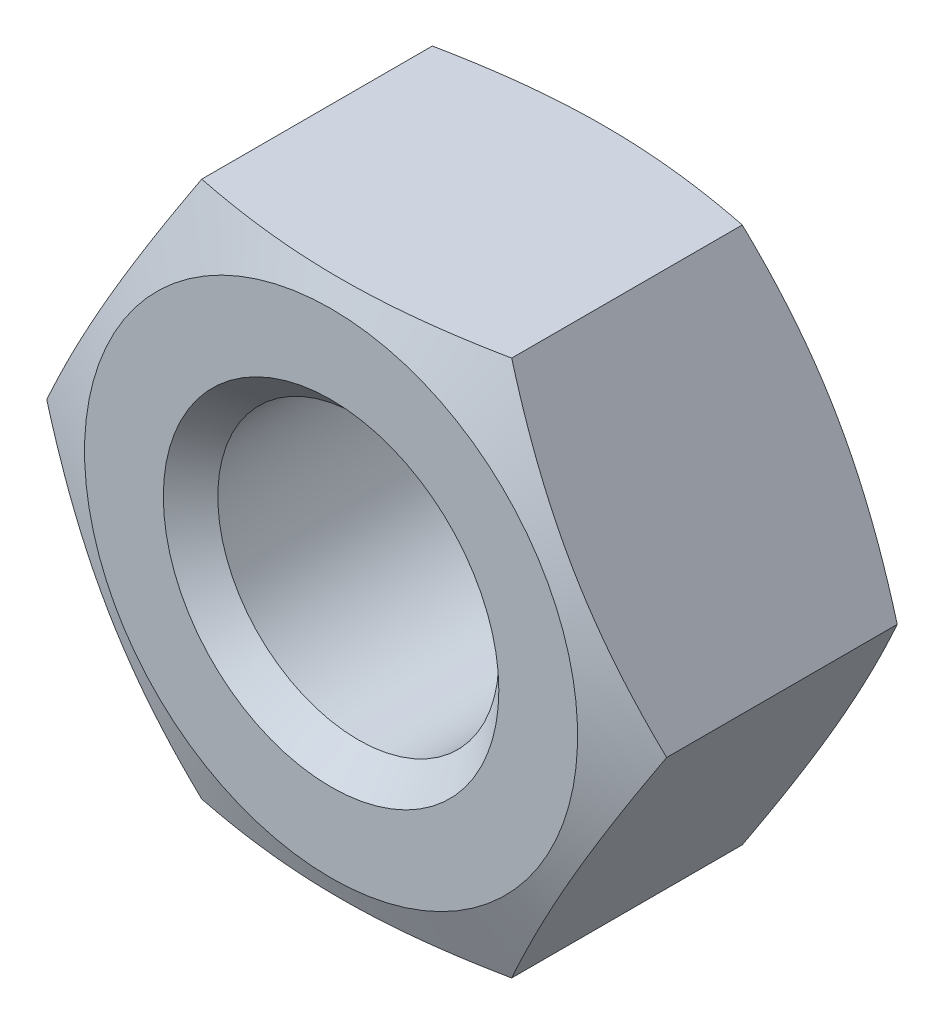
ISO-10303-21;
HEADER;
FILE_DESCRIPTION(('STEP AP214'),'2;1');
FILE_NAME('part.step','',(''),(''),'','','');
FILE_SCHEMA(('AUTOMOTIVE_DESIGN { 1 0 10303 214 1 1 1 1 }'));
ENDSEC;
DATA;
#1=APPLICATION_CONTEXT('core data for automotive mechanical design processes');
#2=APPLICATION_PROTOCOL_DEFINITION('international standard','automotive_design',2000,#1);
#3=PRODUCT_CONTEXT('',#1,'mechanical');
#4=PRODUCT('Part','Part','',(#3));
#5=PRODUCT_RELATED_PRODUCT_CATEGORY('part','',(#4));
#6=PRODUCT_DEFINITION_FORMATION('','',#4);
#7=PRODUCT_DEFINITION_CONTEXT('part definition',#1,'design');
#8=PRODUCT_DEFINITION('design','',#6,#7);
#9=PRODUCT_DEFINITION_SHAPE('','',#8);
#10=(LENGTH_UNIT() NAMED_UNIT(*) SI_UNIT(.MILLI.,.METRE.));
#11=(NAMED_UNIT(*) PLANE_ANGLE_UNIT() SI_UNIT($,.RADIAN.));
#12=(NAMED_UNIT(*) SI_UNIT($,.STERADIAN.) SOLID_ANGLE_UNIT());
#13=UNCERTAINTY_MEASURE_WITH_UNIT(LENGTH_MEASURE(1.E-05),#10,'distance_accuracy_value','');
#14=(GEOMETRIC_REPRESENTATION_CONTEXT(3) GLOBAL_UNCERTAINTY_ASSIGNED_CONTEXT((#13)) GLOBAL_UNIT_ASSIGNED_CONTEXT((#10,
#11,#12)) REPRESENTATION_CONTEXT('',''));
#15=CARTESIAN_POINT('',(0.,0.,0.));
#16=DIRECTION('',(0.,0.,1.));
#17=DIRECTION('',(1.,0.,0.));
#18=AXIS2_PLACEMENT_3D('',#15,#16,#17);
#19=CARTESIAN_POINT('',(9.2376,0.,8.4));
#20=DIRECTION('',(0.,0.,1.));
#21=DIRECTION('',(1.,0.,0.));
#22=AXIS2_PLACEMENT_3D('',#19,#20,#21);
#23=PLANE('',#22);
#24=CARTESIAN_POINT('',(0.,0.,8.4));
#25=DIRECTION('',(0.,0.,-1.));
#26=DIRECTION('',(0.,1.,0.));
#27=AXIS2_PLACEMENT_3D('',#24,#25,#26);
#28=CIRCLE('',#27,5.);
#29=CARTESIAN_POINT('',(0.,5.,8.4));
#30=VERTEX_POINT('',#29);
#31=EDGE_CURVE('E201',#30,#30,#28,.T.);
#32=ORIENTED_EDGE('',*,*,#31,.T.);
#33=EDGE_LOOP('',(#32));
#34=FACE_BOUND('',#33,.T.);
#35=CARTESIAN_POINT('',(0.,0.,8.4));
#36=DIRECTION('',(0.,0.,-1.));
#37=DIRECTION('',(0.,1.,0.));
#38=AXIS2_PLACEMENT_3D('',#35,#36,#37);
#39=CIRCLE('',#38,7.34753367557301);
#40=CARTESIAN_POINT('',(0.,7.34753367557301,8.4));
#41=VERTEX_POINT('',#40);
#42=EDGE_CURVE('E204',#41,#41,#39,.T.);
#43=ORIENTED_EDGE('',*,*,#42,.F.);
#44=EDGE_LOOP('',(#43));
#45=FACE_BOUND('',#44,.T.);
#46=ADVANCED_FACE('F12',(#34,#45),#23,.T.);
#47=CARTESIAN_POINT('',(0.,0.,8.4));
#48=DIRECTION('',(0.,0.,1.));
#49=DIRECTION('',(0.,-1.,0.));
#50=AXIS2_PLACEMENT_3D('',#47,#48,#49);
#51=CONICAL_SURFACE('',#50,5.,0.785398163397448);
#52=CARTESIAN_POINT('',(0.,0.,7.588125));
#53=DIRECTION('',(0.,0.,-1.));
#54=DIRECTION('',(0.,1.,0.));
#55=AXIS2_PLACEMENT_3D('',#52,#53,#54);
#56=CIRCLE('',#55,4.188125);
#57=CARTESIAN_POINT('',(0.,4.188125,7.588125));
#58=VERTEX_POINT('',#57);
#59=EDGE_CURVE('E93',#58,#58,#56,.T.);
#60=ORIENTED_EDGE('',*,*,#59,.T.);
#61=EDGE_LOOP('',(#60));
#62=FACE_BOUND('',#61,.T.);
#63=ORIENTED_EDGE('',*,*,#31,.F.);
#64=EDGE_LOOP('',(#63));
#65=FACE_BOUND('',#64,.T.);
#66=ADVANCED_FACE('F136',(#62,#65),#51,.F.);
#67=CARTESIAN_POINT('',(0.,0.,0.));
#68=DIRECTION('',(0.,0.,-1.));
#69=DIRECTION('',(0.,1.,0.));
#70=AXIS2_PLACEMENT_3D('',#67,#68,#69);
#71=CYLINDRICAL_SURFACE('',#70,4.188125);
#72=CARTESIAN_POINT('',(0.,0.,0.811875));
#73=DIRECTION('',(0.,0.,-1.));
#74=DIRECTION('',(0.,1.,0.));
#75=AXIS2_PLACEMENT_3D('',#72,#73,#74);
#76=CIRCLE('',#75,4.188125);
#77=CARTESIAN_POINT('',(0.,4.188125,0.811875));
#78=VERTEX_POINT('',#77);
#79=EDGE_CURVE('E90',#78,#78,#76,.T.);
#80=ORIENTED_EDGE('',*,*,#79,.T.);
#81=EDGE_LOOP('',(#80));
#82=FACE_BOUND('',#81,.T.);
#83=ORIENTED_EDGE('',*,*,#59,.F.);
#84=EDGE_LOOP('',(#83));
#85=FACE_BOUND('',#84,.T.);
#86=ADVANCED_FACE('F196',(#82,#85),#71,.F.);
#87=CARTESIAN_POINT('',(0.,0.,0.));
#88=DIRECTION('',(0.,0.,-1.));
#89=DIRECTION('',(0.,1.,0.));
#90=AXIS2_PLACEMENT_3D('',#87,#88,#89);
#91=CONICAL_SURFACE('',#90,5.,0.785398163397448);
#92=ORIENTED_EDGE('',*,*,#79,.F.);
#93=EDGE_LOOP('',(#92));
#94=FACE_BOUND('',#93,.T.);
#95=CARTESIAN_POINT('',(0.,0.,0.));
#96=DIRECTION('',(0.,0.,-1.));
#97=DIRECTION('',(0.,1.,0.));
#98=AXIS2_PLACEMENT_3D('',#95,#96,#97);
#99=CIRCLE('',#98,5.);
#100=CARTESIAN_POINT('',(0.,5.,0.));
#101=VERTEX_POINT('',#100);
#102=EDGE_CURVE('E205',#101,#101,#99,.T.);
#103=ORIENTED_EDGE('',*,*,#102,.T.);
#104=EDGE_LOOP('',(#103));
#105=FACE_BOUND('',#104,.T.);
#106=ADVANCED_FACE('F134',(#94,#105),#91,.F.);
#107=CARTESIAN_POINT('',(0.,0.,7.63636363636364));
#108=DIRECTION('',(0.,0.,-1.));
#109=DIRECTION('',(0.,1.,0.));
#110=AXIS2_PLACEMENT_3D('',#107,#108,#109);
#111=CONICAL_SURFACE('',#110,9.2376,1.18682389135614);
#112=ORIENTED_EDGE('',*,*,#42,.T.);
#113=EDGE_LOOP('',(#112));
#114=FACE_BOUND('',#113,.T.);
#115=CARTESIAN_POINT('',(-12.208088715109,-7.99999626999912,5.47151041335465));
#116=CARTESIAN_POINT('',(-11.8472558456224,-7.99999626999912,5.59341262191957));
#117=CARTESIAN_POINT('',(-11.4859428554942,-7.99999626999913,5.71391988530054));
#118=CARTESIAN_POINT('',(-10.7621082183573,-7.99999626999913,5.95136513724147));
#119=CARTESIAN_POINT('',(-10.3995864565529,-7.99999626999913,6.06830277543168));
#120=CARTESIAN_POINT('',(-9.67227861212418,-7.99999626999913,6.29808254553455));
#121=CARTESIAN_POINT('',(-9.30748917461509,-7.99999626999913,6.41091409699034));
#122=CARTESIAN_POINT('',(-8.57626257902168,-7.99999626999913,6.63109410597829));
#123=CARTESIAN_POINT('',(-8.20982546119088,-7.99999626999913,6.73844269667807));
#124=CARTESIAN_POINT('',(-7.47973450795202,-7.99999626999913,6.94493737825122));
#125=CARTESIAN_POINT('',(-7.11610564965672,-7.99999626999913,7.04417133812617));
#126=CARTESIAN_POINT('',(-6.38663585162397,-7.99999626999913,7.23425396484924));
#127=CARTESIAN_POINT('',(-6.02079484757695,-7.99999626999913,7.32510238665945));
#128=CARTESIAN_POINT('',(-5.28684843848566,-7.99999626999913,7.49624245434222));
#129=CARTESIAN_POINT('',(-4.91874442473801,-7.99999626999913,7.57654001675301));
#130=CARTESIAN_POINT('',(-4.17992018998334,-7.99999626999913,7.72409513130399));
#131=CARTESIAN_POINT('',(-3.809200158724,-7.99999626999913,7.79135361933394));
#132=CARTESIAN_POINT('',(-3.1412950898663,-7.99999626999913,7.89787695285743));
#133=CARTESIAN_POINT('',(-2.8445768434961,-7.99999626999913,7.9400537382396));
#134=CARTESIAN_POINT('',(-2.24972708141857,-7.99999626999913,8.0129659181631));
#135=CARTESIAN_POINT('',(-1.95159560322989,-7.99999626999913,8.04370161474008));
#136=CARTESIAN_POINT('',(-1.35447911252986,-7.99999626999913,8.09251487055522));
#137=CARTESIAN_POINT('',(-1.05549477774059,-7.99999626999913,8.11060061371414));
#138=CARTESIAN_POINT('',(-0.457010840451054,-7.99999626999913,8.13335586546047));
#139=CARTESIAN_POINT('',(-0.157511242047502,-7.99999626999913,8.13802548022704));
#140=CARTESIAN_POINT('',(0.44283770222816,-7.99999626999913,8.13372274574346));
#141=CARTESIAN_POINT('',(0.743686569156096,-7.99999626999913,8.12468429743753));
#142=CARTESIAN_POINT('',(1.34468098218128,-7.99999626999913,8.09325950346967));
#143=CARTESIAN_POINT('',(1.6448265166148,-7.99999626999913,8.07087293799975));
#144=CARTESIAN_POINT('',(2.2441114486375,-7.99999626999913,8.01369199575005));
#145=CARTESIAN_POINT('',(2.54325008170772,-7.99999626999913,7.9788897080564));
#146=CARTESIAN_POINT('',(3.14000765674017,-7.99999626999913,7.89819004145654));
#147=CARTESIAN_POINT('',(3.43762660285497,-7.99999626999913,7.8522926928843));
#148=CARTESIAN_POINT('',(4.08078984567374,-7.99999626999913,7.74237997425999));
#149=CARTESIAN_POINT('',(4.42603382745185,-7.99999626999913,7.67661873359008));
#150=CARTESIAN_POINT('',(5.11428681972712,-7.99999626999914,7.53420963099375));
#151=CARTESIAN_POINT('',(5.45729554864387,-7.99999626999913,7.45756042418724));
#152=CARTESIAN_POINT('',(6.14136263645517,-7.99999626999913,7.29534779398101));
#153=CARTESIAN_POINT('',(6.48241994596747,-7.99999626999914,7.20977997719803));
#154=CARTESIAN_POINT('',(7.16262373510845,-7.99999626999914,7.03145121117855));
#155=CARTESIAN_POINT('',(7.50177028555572,-7.99999626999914,6.93869053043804));
#156=CARTESIAN_POINT('',(8.17929752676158,-7.99999626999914,6.74709135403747));
#157=CARTESIAN_POINT('',(8.51767386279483,-7.99999626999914,6.64823752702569));
#158=CARTESIAN_POINT('',(9.19299804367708,-7.99999626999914,6.44577360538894));
#159=CARTESIAN_POINT('',(9.52994587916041,-7.99999626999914,6.34216347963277));
#160=CARTESIAN_POINT('',(10.2025268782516,-7.99999626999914,6.13109100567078));
#161=CARTESIAN_POINT('',(10.5381603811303,-7.99999626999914,6.02362973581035));
#162=CARTESIAN_POINT('',(11.2083889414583,-7.99999626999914,5.80551193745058));
#163=CARTESIAN_POINT('',(11.5429839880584,-7.99999626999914,5.69485537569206));
#164=CARTESIAN_POINT('',(12.5409587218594,-7.99999626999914,5.36044806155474));
#165=CARTESIAN_POINT('',(13.2030406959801,-7.99999626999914,5.13282581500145));
#166=CARTESIAN_POINT('',(14.5246994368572,-7.99999626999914,4.6703057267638));
#167=CARTESIAN_POINT('',(15.1842760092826,-7.99999626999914,4.43540733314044));
#168=CARTESIAN_POINT('',(16.4971634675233,-7.99999626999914,3.96190830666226));
#169=CARTESIAN_POINT('',(17.1504869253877,-7.99999626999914,3.72334248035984));
#170=CARTESIAN_POINT('',(18.1293548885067,-7.99999626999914,3.3625976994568));
#171=CARTESIAN_POINT('',(18.4554375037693,-7.99999626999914,3.24187446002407));
#172=CARTESIAN_POINT('',(19.1072846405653,-7.99999626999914,2.9995757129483));
#173=CARTESIAN_POINT('',(19.4330491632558,-7.99999626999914,2.87800020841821));
#174=CARTESIAN_POINT('',(19.7586760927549,-7.99999626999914,2.75605707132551));
#175=B_SPLINE_CURVE_WITH_KNOTS('',3,(#115,#116,#117,#118,#119,#120,#121,#122,#123,#124,#125,
#126,#127,#128,#129,#130,#131,#132,#133,#134,#135,#136,#137,#138,#139,#140,#141,#142,#143,#144,
#145,#146,#147,#148,#149,#150,#151,#152,#153,#154,#155,#156,#157,#158,#159,#160,#161,#162,#163,
#164,#165,#166,#167,#168,#169,#170,#171,#172,#173,#174),.UNSPECIFIED.,.F.,.F.,(4,2,2,2,2,2,2,2,
2,2,2,2,2,2,2,2,2,2,2,2,2,2,2,2,2,2,2,2,2,4),(0.,1.14261401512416,2.28533982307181,
3.43082722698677,4.57628679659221,5.70698666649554,6.83771956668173,7.9678156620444,
9.0978306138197,9.99674169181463,10.8956290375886,11.7939343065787,12.6922324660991,
13.5948759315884,14.4975342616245,15.4007687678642,16.3040008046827,17.3581349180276,
18.41239935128,19.4671856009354,20.5219324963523,21.5794511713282,22.636976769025,
23.6942085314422,24.7514513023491,26.8517336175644,28.952175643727,31.0387116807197,
32.0818483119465,33.1249811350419),.UNSPECIFIED.);
#176=CARTESIAN_POINT('',(-4.6188,-7.99999626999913,7.63636363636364));
#177=VERTEX_POINT('',#176);
#178=CARTESIAN_POINT('',(4.6188,-7.99999626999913,7.63636363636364));
#179=VERTEX_POINT('',#178);
#180=EDGE_CURVE('E73',#177,#179,#175,.T.);
#181=ORIENTED_EDGE('',*,*,#180,.T.);
#182=CARTESIAN_POINT('',(4.61879988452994,-7.99999646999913,7.63636358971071));
#183=CARTESIAN_POINT('',(4.78016828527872,-7.72049820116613,7.70156440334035));
#184=CARTESIAN_POINT('',(4.94206929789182,-7.44007742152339,7.76185304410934));
#185=CARTESIAN_POINT('',(5.26694187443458,-6.87738161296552,7.87075300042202));
#186=CARTESIAN_POINT('',(5.42991400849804,-6.59510559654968,7.91935747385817));
#187=CARTESIAN_POINT('',(5.75669685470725,-6.02910110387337,8.00294310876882));
#188=CARTESIAN_POINT('',(5.92050730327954,-5.7453730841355,8.03792831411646));
#189=CARTESIAN_POINT('',(6.24873668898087,-5.17686311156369,8.09265414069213));
#190=CARTESIAN_POINT('',(6.41315548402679,-4.89208140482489,8.11239812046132));
#191=CARTESIAN_POINT('',(6.739490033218,-4.32685338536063,8.13541369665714));
#192=CARTESIAN_POINT('',(6.90140088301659,-4.04641556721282,8.13895930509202));
#193=CARTESIAN_POINT('',(7.22512690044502,-3.48570565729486,8.13013256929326));
#194=CARTESIAN_POINT('',(7.38694205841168,-3.20543358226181,8.11775882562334));
#195=CARTESIAN_POINT('',(7.7099879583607,-2.6459016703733,8.07775857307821));
#196=CARTESIAN_POINT('',(7.87121900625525,-2.36664130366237,8.0501417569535));
#197=CARTESIAN_POINT('',(8.19291130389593,-1.80945389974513,7.9809937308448));
#198=CARTESIAN_POINT('',(8.35337262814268,-1.53152673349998,7.93946389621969));
#199=CARTESIAN_POINT('',(8.57389118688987,-1.14957738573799,7.87381724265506));
#200=CARTESIAN_POINT('',(8.63435021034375,-1.04485928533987,7.85492627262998));
#201=CARTESIAN_POINT('',(8.75512556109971,-0.835670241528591,7.81549930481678));
#202=CARTESIAN_POINT('',(8.81544190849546,-0.731199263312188,7.79496355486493));
#203=CARTESIAN_POINT('',(8.93614338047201,-0.522138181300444,7.75226892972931));
#204=CARTESIAN_POINT('',(8.99652803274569,-0.417548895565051,7.73010473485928));
#205=CARTESIAN_POINT('',(9.11716503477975,-0.208599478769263,7.68430965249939));
#206=CARTESIAN_POINT('',(9.17741736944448,-0.104239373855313,7.66067860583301));
#207=CARTESIAN_POINT('',(9.23760011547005,1.99999999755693E-07,7.63636358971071));
#208=B_SPLINE_CURVE_WITH_KNOTS('',3,(#182,#183,#184,#185,#186,#187,#188,#189,#190,#191,#192,
#193,#194,#195,#196,#197,#198,#199,#200,#201,#202,#203,#204,#205,#206,#207),.UNSPECIFIED.,.F.,
.F.,(4,2,2,2,2,2,2,2,2,2,2,2,4),(0.,0.987840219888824,1.97625750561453,2.96438108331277,
3.95228685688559,4.92341776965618,5.89463405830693,6.86523348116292,7.83573698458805,
8.20288448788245,8.56997677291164,8.93832669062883,9.3067166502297),.UNSPECIFIED.);
#209=CARTESIAN_POINT('',(9.2376,0.,7.63636363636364));
#210=VERTEX_POINT('',#209);
#211=EDGE_CURVE('E158',#179,#210,#208,.T.);
#212=ORIENTED_EDGE('',*,*,#211,.T.);
#213=CARTESIAN_POINT('',(9.23760011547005,-2.E-07,7.63636358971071));
#214=CARTESIAN_POINT('',(9.07623171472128,0.279498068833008,7.70156440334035));
#215=CARTESIAN_POINT('',(8.91433070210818,0.559918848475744,7.76185304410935));
#216=CARTESIAN_POINT('',(8.58945812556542,1.12261465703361,7.87075300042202));
#217=CARTESIAN_POINT('',(8.42648599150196,1.40489067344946,7.91935747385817));
#218=CARTESIAN_POINT('',(8.09970314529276,1.97089516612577,8.00294310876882));
#219=CARTESIAN_POINT('',(7.93589269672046,2.25462318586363,8.03792831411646));
#220=CARTESIAN_POINT('',(7.60766331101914,2.82313315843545,8.09265414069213));
#221=CARTESIAN_POINT('',(7.44324451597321,3.10791486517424,8.11239812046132));
#222=CARTESIAN_POINT('',(7.116909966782,3.6731428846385,8.13541369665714));
#223=CARTESIAN_POINT('',(6.95499911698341,3.95358070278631,8.13895930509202));
#224=CARTESIAN_POINT('',(6.63127309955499,4.51429061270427,8.13013256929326));
#225=CARTESIAN_POINT('',(6.46945794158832,4.79456268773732,8.11775882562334));
#226=CARTESIAN_POINT('',(6.1464120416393,5.35409459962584,8.07775857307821));
#227=CARTESIAN_POINT('',(5.98518099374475,5.63335496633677,8.0501417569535));
#228=CARTESIAN_POINT('',(5.66348869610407,6.190542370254,7.9809937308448));
#229=CARTESIAN_POINT('',(5.50302737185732,6.46846953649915,7.93946389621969));
#230=CARTESIAN_POINT('',(5.28250881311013,6.85041888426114,7.87381724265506));
#231=CARTESIAN_POINT('',(5.22204978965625,6.95513698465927,7.85492627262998));
#232=CARTESIAN_POINT('',(5.10127443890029,7.16432602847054,7.81549930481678));
#233=CARTESIAN_POINT('',(5.04095809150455,7.26879700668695,7.79496355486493));
#234=CARTESIAN_POINT('',(4.92025661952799,7.47785808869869,7.75226892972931));
#235=CARTESIAN_POINT('',(4.85987196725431,7.58244737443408,7.73010473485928));
#236=CARTESIAN_POINT('',(4.73923496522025,7.79139679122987,7.68430965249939));
#237=CARTESIAN_POINT('',(4.67898263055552,7.89575689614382,7.66067860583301));
#238=CARTESIAN_POINT('',(4.61879988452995,7.99999646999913,7.63636358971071));
#239=B_SPLINE_CURVE_WITH_KNOTS('',3,(#213,#214,#215,#216,#217,#218,#219,#220,#221,#222,#223,
#224,#225,#226,#227,#228,#229,#230,#231,#232,#233,#234,#235,#236,#237,#238),.UNSPECIFIED.,.F.,
.F.,(4,2,2,2,2,2,2,2,2,2,2,2,4),(0.,0.987840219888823,1.97625750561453,2.96438108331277,
3.95228685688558,4.92341776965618,5.89463405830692,6.86523348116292,7.83573698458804,
8.20288448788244,8.56997677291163,8.93832669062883,9.3067166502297),.UNSPECIFIED.);
#240=CARTESIAN_POINT('',(4.6188,7.99999626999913,7.63636363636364));
#241=VERTEX_POINT('',#240);
#242=EDGE_CURVE('E35',#210,#241,#239,.T.);
#243=ORIENTED_EDGE('',*,*,#242,.T.);
#244=CARTESIAN_POINT('',(-12.208088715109,7.99999626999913,5.47151041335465));
#245=CARTESIAN_POINT('',(-11.8472558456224,7.99999626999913,5.59341262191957));
#246=CARTESIAN_POINT('',(-11.4859428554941,7.99999626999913,5.71391988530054));
#247=CARTESIAN_POINT('',(-10.7621082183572,7.99999626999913,5.95136513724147));
#248=CARTESIAN_POINT('',(-10.3995864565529,7.99999626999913,6.06830277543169));
#249=CARTESIAN_POINT('',(-9.67227861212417,7.99999626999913,6.29808254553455));
#250=CARTESIAN_POINT('',(-9.30748917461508,7.99999626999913,6.41091409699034));
#251=CARTESIAN_POINT('',(-8.57626257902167,7.99999626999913,6.6310941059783));
#252=CARTESIAN_POINT('',(-8.20982546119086,7.99999626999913,6.73844269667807));
#253=CARTESIAN_POINT('',(-7.47973450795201,7.99999626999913,6.94493737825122));
#254=CARTESIAN_POINT('',(-7.11610564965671,7.99999626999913,7.04417133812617));
#255=CARTESIAN_POINT('',(-6.38663585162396,7.99999626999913,7.23425396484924));
#256=CARTESIAN_POINT('',(-6.02079484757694,7.99999626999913,7.32510238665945));
#257=CARTESIAN_POINT('',(-5.28684843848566,7.99999626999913,7.49624245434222));
#258=CARTESIAN_POINT('',(-4.91874442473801,7.99999626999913,7.57654001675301));
#259=CARTESIAN_POINT('',(-4.17992018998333,7.99999626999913,7.72409513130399));
#260=CARTESIAN_POINT('',(-3.809200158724,7.99999626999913,7.79135361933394));
#261=CARTESIAN_POINT('',(-3.14129508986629,7.99999626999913,7.89787695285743));
#262=CARTESIAN_POINT('',(-2.84457684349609,7.99999626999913,7.9400537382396));
#263=CARTESIAN_POINT('',(-2.24972708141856,7.99999626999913,8.0129659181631));
#264=CARTESIAN_POINT('',(-1.95159560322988,7.99999626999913,8.04370161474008));
#265=CARTESIAN_POINT('',(-1.35447911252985,7.99999626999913,8.09251487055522));
#266=CARTESIAN_POINT('',(-1.05549477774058,7.99999626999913,8.11060061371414));
#267=CARTESIAN_POINT('',(-0.457010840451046,7.99999626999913,8.13335586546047));
#268=CARTESIAN_POINT('',(-0.157511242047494,7.99999626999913,8.13802548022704));
#269=CARTESIAN_POINT('',(0.442837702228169,7.99999626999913,8.13372274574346));
#270=CARTESIAN_POINT('',(0.743686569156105,7.99999626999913,8.12468429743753));
#271=CARTESIAN_POINT('',(1.34468098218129,7.99999626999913,8.09325950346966));
#272=CARTESIAN_POINT('',(1.64482651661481,7.99999626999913,8.07087293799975));
#273=CARTESIAN_POINT('',(2.24411144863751,7.99999626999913,8.01369199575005));
#274=CARTESIAN_POINT('',(2.54325008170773,7.99999626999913,7.9788897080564));
#275=CARTESIAN_POINT('',(3.14000765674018,7.99999626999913,7.89819004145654));
#276=CARTESIAN_POINT('',(3.43762660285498,7.99999626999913,7.8522926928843));
#277=CARTESIAN_POINT('',(4.08078984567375,7.99999626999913,7.74237997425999));
#278=CARTESIAN_POINT('',(4.42603382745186,7.99999626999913,7.67661873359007));
#279=CARTESIAN_POINT('',(5.11428681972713,7.99999626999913,7.53420963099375));
#280=CARTESIAN_POINT('',(5.45729554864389,7.99999626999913,7.45756042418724));
#281=CARTESIAN_POINT('',(6.14136263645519,7.99999626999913,7.295347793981));
#282=CARTESIAN_POINT('',(6.48241994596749,7.99999626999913,7.20977997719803));
#283=CARTESIAN_POINT('',(7.16262373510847,7.99999626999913,7.03145121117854));
#284=CARTESIAN_POINT('',(7.50177028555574,7.99999626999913,6.93869053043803));
#285=CARTESIAN_POINT('',(8.17929752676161,7.99999626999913,6.74709135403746));
#286=CARTESIAN_POINT('',(8.51767386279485,7.99999626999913,6.64823752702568));
#287=CARTESIAN_POINT('',(9.1929980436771,7.99999626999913,6.44577360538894));
#288=CARTESIAN_POINT('',(9.52994587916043,7.99999626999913,6.34216347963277));
#289=CARTESIAN_POINT('',(10.2025268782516,7.99999626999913,6.13109100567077));
#290=CARTESIAN_POINT('',(10.5381603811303,7.99999626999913,6.02362973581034));
#291=CARTESIAN_POINT('',(11.2083889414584,7.99999626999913,5.80551193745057));
#292=CARTESIAN_POINT('',(11.5429839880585,7.99999626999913,5.69485537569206));
#293=CARTESIAN_POINT('',(12.5409587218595,7.99999626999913,5.36044806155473));
#294=CARTESIAN_POINT('',(13.2030406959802,7.99999626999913,5.13282581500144));
#295=CARTESIAN_POINT('',(14.5246994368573,7.99999626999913,4.67030572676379));
#296=CARTESIAN_POINT('',(15.1842760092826,7.99999626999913,4.43540733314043));
#297=CARTESIAN_POINT('',(16.4971634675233,7.99999626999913,3.96190830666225));
#298=CARTESIAN_POINT('',(17.1504869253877,7.99999626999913,3.72334248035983));
#299=CARTESIAN_POINT('',(18.1293548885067,7.99999626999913,3.36259769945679));
#300=CARTESIAN_POINT('',(18.4554375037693,7.99999626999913,3.24187446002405));
#301=CARTESIAN_POINT('',(19.1072846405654,7.99999626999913,2.99957571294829));
#302=CARTESIAN_POINT('',(19.4330491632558,7.99999626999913,2.8780002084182));
#303=CARTESIAN_POINT('',(19.7586760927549,7.99999626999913,2.7560570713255));
#304=B_SPLINE_CURVE_WITH_KNOTS('',3,(#244,#245,#246,#247,#248,#249,#250,#251,#252,#253,#254,
#255,#256,#257,#258,#259,#260,#261,#262,#263,#264,#265,#266,#267,#268,#269,#270,#271,#272,#273,
#274,#275,#276,#277,#278,#279,#280,#281,#282,#283,#284,#285,#286,#287,#288,#289,#290,#291,#292,
#293,#294,#295,#296,#297,#298,#299,#300,#301,#302,#303),.UNSPECIFIED.,.F.,.F.,(4,2,2,2,2,2,2,2,
2,2,2,2,2,2,2,2,2,2,2,2,2,2,2,2,2,2,2,2,2,4),(0.,1.14261401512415,2.2853398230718,
3.43082722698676,4.57628679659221,5.70698666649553,6.83771956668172,7.96781566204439,
9.09783061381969,9.99674169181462,10.8956290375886,11.7939343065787,12.6922324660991,
13.5948759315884,14.4975342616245,15.4007687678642,16.3040008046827,17.3581349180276,
18.41239935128,19.4671856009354,20.5219324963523,21.5794511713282,22.636976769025,
23.6942085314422,24.7514513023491,26.8517336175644,28.952175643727,31.0387116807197,
32.0818483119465,33.1249811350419),.UNSPECIFIED.);
#305=CARTESIAN_POINT('',(-4.6188,7.99999626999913,7.63636363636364));
#306=VERTEX_POINT('',#305);
#307=EDGE_CURVE('E149',#241,#306,#304,.F.);
#308=ORIENTED_EDGE('',*,*,#307,.T.);
#309=CARTESIAN_POINT('',(-4.61879988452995,7.99999646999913,7.63636358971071));
#310=CARTESIAN_POINT('',(-4.78016828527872,7.72049820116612,7.70156440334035));
#311=CARTESIAN_POINT('',(-4.94206929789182,7.44007742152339,7.76185304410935));
#312=CARTESIAN_POINT('',(-5.26694187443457,6.87738161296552,7.87075300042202));
#313=CARTESIAN_POINT('',(-5.42991400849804,6.59510559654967,7.91935747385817));
#314=CARTESIAN_POINT('',(-5.75669685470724,6.02910110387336,8.00294310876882));
#315=CARTESIAN_POINT('',(-5.92050730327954,5.7453730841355,8.03792831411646));
#316=CARTESIAN_POINT('',(-6.24873668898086,5.17686311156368,8.09265414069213));
#317=CARTESIAN_POINT('',(-6.41315548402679,4.89208140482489,8.11239812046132));
#318=CARTESIAN_POINT('',(-6.739490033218,4.32685338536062,8.13541369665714));
#319=CARTESIAN_POINT('',(-6.90140088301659,4.04641556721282,8.13895930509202));
#320=CARTESIAN_POINT('',(-7.22512690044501,3.48570565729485,8.13013256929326));
#321=CARTESIAN_POINT('',(-7.38694205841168,3.20543358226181,8.11775882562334));
#322=CARTESIAN_POINT('',(-7.7099879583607,2.64590167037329,8.07775857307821));
#323=CARTESIAN_POINT('',(-7.87121900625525,2.36664130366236,8.0501417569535));
#324=CARTESIAN_POINT('',(-8.19291130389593,1.80945389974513,7.9809937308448));
#325=CARTESIAN_POINT('',(-8.35337262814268,1.53152673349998,7.93946389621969));
#326=CARTESIAN_POINT('',(-8.57389118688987,1.14957738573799,7.87381724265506));
#327=CARTESIAN_POINT('',(-8.63435021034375,1.04485928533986,7.85492627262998));
#328=CARTESIAN_POINT('',(-8.75512556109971,0.835670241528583,7.81549930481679));
#329=CARTESIAN_POINT('',(-8.81544190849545,0.731199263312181,7.79496355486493));
#330=CARTESIAN_POINT('',(-8.93614338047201,0.522138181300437,7.75226892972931));
#331=CARTESIAN_POINT('',(-8.99652803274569,0.417548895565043,7.73010473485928));
#332=CARTESIAN_POINT('',(-9.11716503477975,0.208599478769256,7.68430965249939));
#333=CARTESIAN_POINT('',(-9.17741736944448,0.104239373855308,7.66067860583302));
#334=CARTESIAN_POINT('',(-9.23760011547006,-2.00000001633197E-07,7.63636358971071));
#335=B_SPLINE_CURVE_WITH_KNOTS('',3,(#309,#310,#311,#312,#313,#314,#315,#316,#317,#318,#319,
#320,#321,#322,#323,#324,#325,#326,#327,#328,#329,#330,#331,#332,#333,#334),.UNSPECIFIED.,.F.,
.F.,(4,2,2,2,2,2,2,2,2,2,2,2,4),(0.,0.987840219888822,1.97625750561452,2.96438108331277,
3.95228685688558,4.92341776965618,5.89463405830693,6.86523348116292,7.83573698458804,
8.20288448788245,8.56997677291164,8.93832669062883,9.3067166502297),.UNSPECIFIED.);
#336=CARTESIAN_POINT('',(-9.2376,0.,7.63636363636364));
#337=VERTEX_POINT('',#336);
#338=EDGE_CURVE('E144',#306,#337,#335,.T.);
#339=ORIENTED_EDGE('',*,*,#338,.T.);
#340=CARTESIAN_POINT('',(-9.23760011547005,1.99999997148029E-07,7.63636358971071));
#341=CARTESIAN_POINT('',(-9.07623171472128,-0.27949806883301,7.70156440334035));
#342=CARTESIAN_POINT('',(-8.91433070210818,-0.559918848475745,7.76185304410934));
#343=CARTESIAN_POINT('',(-8.58945812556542,-1.12261465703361,7.87075300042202));
#344=CARTESIAN_POINT('',(-8.42648599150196,-1.40489067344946,7.91935747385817));
#345=CARTESIAN_POINT('',(-8.09970314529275,-1.97089516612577,8.00294310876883));
#346=CARTESIAN_POINT('',(-7.93589269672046,-2.25462318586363,8.03792831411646));
#347=CARTESIAN_POINT('',(-7.60766331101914,-2.82313315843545,8.09265414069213));
#348=CARTESIAN_POINT('',(-7.44324451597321,-3.10791486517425,8.11239812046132));
#349=CARTESIAN_POINT('',(-7.116909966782,-3.67314288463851,8.13541369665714));
#350=CARTESIAN_POINT('',(-6.95499911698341,-3.95358070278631,8.13895930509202));
#351=CARTESIAN_POINT('',(-6.63127309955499,-4.51429061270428,8.13013256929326));
#352=CARTESIAN_POINT('',(-6.46945794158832,-4.79456268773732,8.11775882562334));
#353=CARTESIAN_POINT('',(-6.1464120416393,-5.35409459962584,8.07775857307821));
#354=CARTESIAN_POINT('',(-5.98518099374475,-5.63335496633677,8.0501417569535));
#355=CARTESIAN_POINT('',(-5.66348869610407,-6.190542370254,7.9809937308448));
#356=CARTESIAN_POINT('',(-5.50302737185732,-6.46846953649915,7.93946389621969));
#357=CARTESIAN_POINT('',(-5.28250881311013,-6.85041888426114,7.87381724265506));
#358=CARTESIAN_POINT('',(-5.22204978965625,-6.95513698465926,7.85492627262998));
#359=CARTESIAN_POINT('',(-5.10127443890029,-7.16432602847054,7.81549930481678));
#360=CARTESIAN_POINT('',(-5.04095809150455,-7.26879700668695,7.79496355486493));
#361=CARTESIAN_POINT('',(-4.92025661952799,-7.47785808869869,7.75226892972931));
#362=CARTESIAN_POINT('',(-4.85987196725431,-7.58244737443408,7.73010473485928));
#363=CARTESIAN_POINT('',(-4.73923496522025,-7.79139679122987,7.68430965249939));
#364=CARTESIAN_POINT('',(-4.67898263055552,-7.89575689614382,7.66067860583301));
#365=CARTESIAN_POINT('',(-4.61879988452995,-7.99999646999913,7.63636358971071));
#366=B_SPLINE_CURVE_WITH_KNOTS('',3,(#340,#341,#342,#343,#344,#345,#346,#347,#348,#349,#350,
#351,#352,#353,#354,#355,#356,#357,#358,#359,#360,#361,#362,#363,#364,#365),.UNSPECIFIED.,.F.,
.F.,(4,2,2,2,2,2,2,2,2,2,2,2,4),(0.,0.987840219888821,1.97625750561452,2.96438108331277,
3.95228685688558,4.92341776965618,5.89463405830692,6.86523348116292,7.83573698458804,
8.20288448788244,8.56997677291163,8.93832669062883,9.3067166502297),.UNSPECIFIED.);
#367=EDGE_CURVE('E121',#337,#177,#366,.T.);
#368=ORIENTED_EDGE('',*,*,#367,.T.);
#369=EDGE_LOOP('',(#181,#212,#243,#308,#339,#368));
#370=FACE_BOUND('',#369,.T.);
#371=ADVANCED_FACE('F130',(#114,#370),#111,.T.);
#372=CARTESIAN_POINT('',(4.6188,-7.99999626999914,8.4));
#373=DIRECTION('',(-0.866025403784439,0.5,0.));
#374=DIRECTION('',(-0.5,-0.866025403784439,0.));
#375=AXIS2_PLACEMENT_3D('',#372,#373,#374);
#376=PLANE('',#375);
#377=ORIENTED_EDGE('',*,*,#211,.F.);
#378=DIRECTION('',(0.,0.,-1.));
#379=VECTOR('',#378,1.);
#380=CARTESIAN_POINT('',(4.6188,-7.99999626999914,8.4));
#381=LINE('',#380,#379);
#382=CARTESIAN_POINT('',(4.6188,-7.99999626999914,0.763636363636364));
#383=VERTEX_POINT('',#382);
#384=EDGE_CURVE('E77',#179,#383,#381,.T.);
#385=ORIENTED_EDGE('',*,*,#384,.T.);
#386=CARTESIAN_POINT('',(9.23760011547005,2.E-07,0.763636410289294));
#387=CARTESIAN_POINT('',(9.07623171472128,-0.279498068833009,0.698435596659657));
#388=CARTESIAN_POINT('',(8.91433070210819,-0.559918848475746,0.63814695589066));
#389=CARTESIAN_POINT('',(8.58945812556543,-1.12261465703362,0.529246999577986));
#390=CARTESIAN_POINT('',(8.42648599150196,-1.40489067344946,0.480642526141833));
#391=CARTESIAN_POINT('',(8.09970314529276,-1.97089516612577,0.397056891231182));
#392=CARTESIAN_POINT('',(7.93589269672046,-2.25462318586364,0.362071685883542));
#393=CARTESIAN_POINT('',(7.60766331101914,-2.82313315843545,0.307345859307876));
#394=CARTESIAN_POINT('',(7.44324451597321,-3.10791486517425,0.287601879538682));
#395=CARTESIAN_POINT('',(7.116909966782,-3.67314288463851,0.264586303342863));
#396=CARTESIAN_POINT('',(6.95499911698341,-3.95358070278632,0.261040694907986));
#397=CARTESIAN_POINT('',(6.63127309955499,-4.51429061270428,0.269867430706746));
#398=CARTESIAN_POINT('',(6.46945794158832,-4.79456268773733,0.282241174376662));
#399=CARTESIAN_POINT('',(6.1464120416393,-5.35409459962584,0.322241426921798));
#400=CARTESIAN_POINT('',(5.98518099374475,-5.63335496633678,0.349858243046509));
#401=CARTESIAN_POINT('',(5.66348869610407,-6.19054237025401,0.419006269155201));
#402=CARTESIAN_POINT('',(5.50302737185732,-6.46846953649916,0.46053610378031));
#403=CARTESIAN_POINT('',(5.28250881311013,-6.85041888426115,0.526182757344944));
#404=CARTESIAN_POINT('',(5.22204978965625,-6.95513698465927,0.545073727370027));
#405=CARTESIAN_POINT('',(5.10127443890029,-7.16432602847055,0.584500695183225));
#406=CARTESIAN_POINT('',(5.04095809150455,-7.26879700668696,0.60503644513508));
#407=CARTESIAN_POINT('',(4.92025661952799,-7.4778580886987,0.647731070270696));
#408=CARTESIAN_POINT('',(4.85987196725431,-7.5824473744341,0.669895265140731));
#409=CARTESIAN_POINT('',(4.73923496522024,-7.79139679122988,0.715690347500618));
#410=CARTESIAN_POINT('',(4.67898263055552,-7.89575689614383,0.739321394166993));
#411=CARTESIAN_POINT('',(4.61879988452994,-7.99999646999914,0.763636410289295));
#412=B_SPLINE_CURVE_WITH_KNOTS('',3,(#386,#387,#388,#389,#390,#391,#392,#393,#394,#395,#396,
#397,#398,#399,#400,#401,#402,#403,#404,#405,#406,#407,#408,#409,#410,#411),.UNSPECIFIED.,.F.,
.F.,(4,2,2,2,2,2,2,2,2,2,2,2,4),(0.,0.987840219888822,1.97625750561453,2.96438108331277,
3.95228685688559,4.92341776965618,5.89463405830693,6.86523348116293,7.83573698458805,
8.20288448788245,8.56997677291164,8.93832669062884,9.30671665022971),.UNSPECIFIED.);
#413=CARTESIAN_POINT('',(9.2376,0.,0.763636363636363));
#414=VERTEX_POINT('',#413);
#415=EDGE_CURVE('E28',#414,#383,#412,.T.);
#416=ORIENTED_EDGE('',*,*,#415,.F.);
#417=DIRECTION('',(0.,0.,-1.));
#418=VECTOR('',#417,1.);
#419=CARTESIAN_POINT('',(9.2376,0.,8.4));
#420=LINE('',#419,#418);
#421=EDGE_CURVE('E21',#210,#414,#420,.T.);
#422=ORIENTED_EDGE('',*,*,#421,.F.);
#423=EDGE_LOOP('',(#377,#385,#416,#422));
#424=FACE_BOUND('',#423,.T.);
#425=ADVANCED_FACE('F14',(#424),#376,.F.);
#426=CARTESIAN_POINT('',(9.2376,0.,8.4));
#427=DIRECTION('',(-0.866025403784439,-0.5,0.));
#428=DIRECTION('',(0.5,-0.866025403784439,0.));
#429=AXIS2_PLACEMENT_3D('',#426,#427,#428);
#430=PLANE('',#429);
#431=ORIENTED_EDGE('',*,*,#242,.F.);
#432=ORIENTED_EDGE('',*,*,#421,.T.);
#433=CARTESIAN_POINT('',(4.61879988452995,7.99999646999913,0.763636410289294));
#434=CARTESIAN_POINT('',(4.78016828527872,7.72049820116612,0.698435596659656));
#435=CARTESIAN_POINT('',(4.94206929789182,7.44007742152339,0.638146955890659));
#436=CARTESIAN_POINT('',(5.26694187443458,6.87738161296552,0.529246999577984));
#437=CARTESIAN_POINT('',(5.42991400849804,6.59510559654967,0.480642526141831));
#438=CARTESIAN_POINT('',(5.75669685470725,6.02910110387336,0.39705689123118));
#439=CARTESIAN_POINT('',(5.92050730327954,5.74537308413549,0.362071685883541));
#440=CARTESIAN_POINT('',(6.24873668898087,5.17686311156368,0.307345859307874));
#441=CARTESIAN_POINT('',(6.41315548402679,4.89208140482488,0.28760187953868));
#442=CARTESIAN_POINT('',(6.739490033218,4.32685338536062,0.264586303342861));
#443=CARTESIAN_POINT('',(6.90140088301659,4.04641556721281,0.261040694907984));
#444=CARTESIAN_POINT('',(7.22512690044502,3.48570565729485,0.269867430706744));
#445=CARTESIAN_POINT('',(7.38694205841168,3.20543358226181,0.28224117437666));
#446=CARTESIAN_POINT('',(7.7099879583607,2.64590167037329,0.322241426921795));
#447=CARTESIAN_POINT('',(7.87121900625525,2.36664130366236,0.349858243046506));
#448=CARTESIAN_POINT('',(8.19291130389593,1.80945389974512,0.4190062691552));
#449=CARTESIAN_POINT('',(8.35337262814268,1.53152673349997,0.460536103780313));
#450=CARTESIAN_POINT('',(8.57389118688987,1.14957738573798,0.526182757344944));
#451=CARTESIAN_POINT('',(8.63435021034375,1.04485928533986,0.545073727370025));
#452=CARTESIAN_POINT('',(8.75512556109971,0.835670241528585,0.584500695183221));
#453=CARTESIAN_POINT('',(8.81544190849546,0.731199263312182,0.605036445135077));
#454=CARTESIAN_POINT('',(8.93614338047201,0.522138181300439,0.647731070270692));
#455=CARTESIAN_POINT('',(8.99652803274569,0.417548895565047,0.669895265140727));
#456=CARTESIAN_POINT('',(9.11716503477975,0.208599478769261,0.715690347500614));
#457=CARTESIAN_POINT('',(9.17741736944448,0.104239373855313,0.739321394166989));
#458=CARTESIAN_POINT('',(9.23760011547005,-1.9999999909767E-07,0.763636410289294));
#459=B_SPLINE_CURVE_WITH_KNOTS('',3,(#433,#434,#435,#436,#437,#438,#439,#440,#441,#442,#443,
#444,#445,#446,#447,#448,#449,#450,#451,#452,#453,#454,#455,#456,#457,#458),.UNSPECIFIED.,.F.,
.F.,(4,2,2,2,2,2,2,2,2,2,2,2,4),(0.,0.987840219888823,1.97625750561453,2.96438108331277,
3.95228685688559,4.92341776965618,5.89463405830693,6.86523348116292,7.83573698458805,
8.20288448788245,8.56997677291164,8.93832669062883,9.3067166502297),.UNSPECIFIED.);
#460=CARTESIAN_POINT('',(4.6188,7.99999626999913,0.763636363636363));
#461=VERTEX_POINT('',#460);
#462=EDGE_CURVE('E169',#461,#414,#459,.T.);
#463=ORIENTED_EDGE('',*,*,#462,.F.);
#464=DIRECTION('',(0.,0.,-1.));
#465=VECTOR('',#464,1.);
#466=CARTESIAN_POINT('',(4.6188,7.99999626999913,8.4));
#467=LINE('',#466,#465);
#468=EDGE_CURVE('E242',#241,#461,#467,.T.);
#469=ORIENTED_EDGE('',*,*,#468,.F.);
#470=EDGE_LOOP('',(#431,#432,#463,#469));
#471=FACE_BOUND('',#470,.T.);
#472=ADVANCED_FACE('F163',(#471),#430,.F.);
#473=CARTESIAN_POINT('',(4.6188,7.99999626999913,8.4));
#474=DIRECTION('',(0.,-1.,0.));
#475=DIRECTION('',(1.,0.,0.));
#476=AXIS2_PLACEMENT_3D('',#473,#474,#475);
#477=PLANE('',#476);
#478=ORIENTED_EDGE('',*,*,#307,.F.);
#479=ORIENTED_EDGE('',*,*,#468,.T.);
#480=CARTESIAN_POINT('',(-12.208088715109,7.99999626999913,2.92848958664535));
#481=CARTESIAN_POINT('',(-11.8472558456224,7.99999626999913,2.80658737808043));
#482=CARTESIAN_POINT('',(-11.4859428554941,7.99999626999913,2.68608011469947));
#483=CARTESIAN_POINT('',(-10.7621082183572,7.99999626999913,2.44863486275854));
#484=CARTESIAN_POINT('',(-10.3995864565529,7.99999626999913,2.33169722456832));
#485=CARTESIAN_POINT('',(-9.67227861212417,7.99999626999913,2.10191745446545));
#486=CARTESIAN_POINT('',(-9.30748917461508,7.99999626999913,1.98908590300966));
#487=CARTESIAN_POINT('',(-8.57626257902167,7.99999626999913,1.76890589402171));
#488=CARTESIAN_POINT('',(-8.20982546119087,7.99999626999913,1.66155730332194));
#489=CARTESIAN_POINT('',(-7.47973450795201,7.99999626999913,1.45506262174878));
#490=CARTESIAN_POINT('',(-7.11610564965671,7.99999626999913,1.35582866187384));
#491=CARTESIAN_POINT('',(-6.38663585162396,7.99999626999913,1.16574603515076));
#492=CARTESIAN_POINT('',(-6.02079484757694,7.99999626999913,1.07489761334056));
#493=CARTESIAN_POINT('',(-5.28684843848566,7.99999626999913,0.903757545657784));
#494=CARTESIAN_POINT('',(-4.918744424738,7.99999626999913,0.823459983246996));
#495=CARTESIAN_POINT('',(-4.17992018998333,7.99999626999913,0.675904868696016));
#496=CARTESIAN_POINT('',(-3.80920015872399,7.99999626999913,0.608646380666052));
#497=CARTESIAN_POINT('',(-3.14129508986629,7.99999626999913,0.502123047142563));
#498=CARTESIAN_POINT('',(-2.84457684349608,7.99999626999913,0.459946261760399));
#499=CARTESIAN_POINT('',(-2.24972708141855,7.99999626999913,0.387034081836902));
#500=CARTESIAN_POINT('',(-1.95159560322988,7.99999626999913,0.356298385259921));
#501=CARTESIAN_POINT('',(-1.35447911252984,7.99999626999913,0.307485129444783));
#502=CARTESIAN_POINT('',(-1.05549477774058,7.99999626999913,0.289399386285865));
#503=CARTESIAN_POINT('',(-0.457010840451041,7.99999626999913,0.266644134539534));
#504=CARTESIAN_POINT('',(-0.157511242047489,7.99999626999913,0.261974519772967));
#505=CARTESIAN_POINT('',(0.442837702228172,7.99999626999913,0.266277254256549));
#506=CARTESIAN_POINT('',(0.743686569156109,7.99999626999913,0.275315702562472));
#507=CARTESIAN_POINT('',(1.34468098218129,7.99999626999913,0.306740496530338));
#508=CARTESIAN_POINT('',(1.64482651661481,7.99999626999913,0.329127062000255));
#509=CARTESIAN_POINT('',(2.24411144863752,7.99999626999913,0.386308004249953));
#510=CARTESIAN_POINT('',(2.54325008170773,7.99999626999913,0.421110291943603));
#511=CARTESIAN_POINT('',(3.14000765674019,7.99999626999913,0.501809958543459));
#512=CARTESIAN_POINT('',(3.43762660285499,7.99999626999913,0.547707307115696));
#513=CARTESIAN_POINT('',(4.08078984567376,7.99999626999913,0.657620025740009));
#514=CARTESIAN_POINT('',(4.42603382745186,7.99999626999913,0.723381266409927));
#515=CARTESIAN_POINT('',(5.11428681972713,7.99999626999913,0.865790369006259));
#516=CARTESIAN_POINT('',(5.45729554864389,7.99999626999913,0.942439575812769));
#517=CARTESIAN_POINT('',(6.14136263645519,7.99999626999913,1.104652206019));
#518=CARTESIAN_POINT('',(6.4824199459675,7.99999626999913,1.19022002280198));
#519=CARTESIAN_POINT('',(7.16262373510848,7.99999626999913,1.36854878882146));
#520=CARTESIAN_POINT('',(7.50177028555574,7.99999626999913,1.46130946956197));
#521=CARTESIAN_POINT('',(8.17929752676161,7.99999626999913,1.65290864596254));
#522=CARTESIAN_POINT('',(8.51767386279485,7.99999626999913,1.75176247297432));
#523=CARTESIAN_POINT('',(9.19299804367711,7.99999626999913,1.95422639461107));
#524=CARTESIAN_POINT('',(9.52994587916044,7.99999626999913,2.05783652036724));
#525=CARTESIAN_POINT('',(10.2025268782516,7.99999626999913,2.26890899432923));
#526=CARTESIAN_POINT('',(10.5381603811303,7.99999626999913,2.37637026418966));
#527=CARTESIAN_POINT('',(11.2083889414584,7.99999626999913,2.59448806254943));
#528=CARTESIAN_POINT('',(11.5429839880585,7.99999626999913,2.70514462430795));
#529=CARTESIAN_POINT('',(12.5409587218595,7.99999626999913,3.03955193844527));
#530=CARTESIAN_POINT('',(13.2030406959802,7.99999626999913,3.26717418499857));
#531=CARTESIAN_POINT('',(14.5246994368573,7.99999626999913,3.72969427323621));
#532=CARTESIAN_POINT('',(15.1842760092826,7.99999626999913,3.96459266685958));
#533=CARTESIAN_POINT('',(16.4971634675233,7.99999626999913,4.43809169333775));
#534=CARTESIAN_POINT('',(17.1504869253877,7.99999626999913,4.67665751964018));
#535=CARTESIAN_POINT('',(18.1293548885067,7.99999626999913,5.03740230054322));
#536=CARTESIAN_POINT('',(18.4554375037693,7.99999626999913,5.15812553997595));
#537=CARTESIAN_POINT('',(19.1072846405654,7.99999626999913,5.40042428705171));
#538=CARTESIAN_POINT('',(19.4330491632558,7.99999626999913,5.5219997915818));
#539=CARTESIAN_POINT('',(19.7586760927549,7.99999626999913,5.64394292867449));
#540=B_SPLINE_CURVE_WITH_KNOTS('',3,(#480,#481,#482,#483,#484,#485,#486,#487,#488,#489,#490,
#491,#492,#493,#494,#495,#496,#497,#498,#499,#500,#501,#502,#503,#504,#505,#506,#507,#508,#509,
#510,#511,#512,#513,#514,#515,#516,#517,#518,#519,#520,#521,#522,#523,#524,#525,#526,#527,#528,
#529,#530,#531,#532,#533,#534,#535,#536,#537,#538,#539),.UNSPECIFIED.,.F.,.F.,(4,2,2,2,2,2,2,2,
2,2,2,2,2,2,2,2,2,2,2,2,2,2,2,2,2,2,2,2,2,4),(0.,1.14261401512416,2.28533982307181,
3.43082722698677,4.57628679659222,5.70698666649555,6.83771956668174,7.96781566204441,
9.09783061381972,9.99674169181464,10.8956290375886,11.7939343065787,12.6922324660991,
13.5948759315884,14.4975342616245,15.4007687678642,16.3040008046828,17.3581349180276,
18.4123993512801,19.4671856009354,20.5219324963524,21.5794511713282,22.636976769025,
23.6942085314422,24.7514513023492,26.8517336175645,28.952175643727,31.0387116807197,
32.0818483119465,33.1249811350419),.UNSPECIFIED.);
#541=CARTESIAN_POINT('',(-4.6188,7.99999626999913,0.763636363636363));
#542=VERTEX_POINT('',#541);
#543=EDGE_CURVE('E174',#542,#461,#540,.T.);
#544=ORIENTED_EDGE('',*,*,#543,.F.);
#545=DIRECTION('',(0.,0.,-1.));
#546=VECTOR('',#545,1.);
#547=CARTESIAN_POINT('',(-4.6188,7.99999626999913,8.4));
#548=LINE('',#547,#546);
#549=EDGE_CURVE('E244',#306,#542,#548,.T.);
#550=ORIENTED_EDGE('',*,*,#549,.F.);
#551=EDGE_LOOP('',(#478,#479,#544,#550));
#552=FACE_BOUND('',#551,.T.);
#553=ADVANCED_FACE('F166',(#552),#477,.F.);
#554=CARTESIAN_POINT('',(-4.6188,7.99999626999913,8.4));
#555=DIRECTION('',(0.866025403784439,-0.5,0.));
#556=DIRECTION('',(0.5,0.866025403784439,0.));
#557=AXIS2_PLACEMENT_3D('',#554,#555,#556);
#558=PLANE('',#557);
#559=ORIENTED_EDGE('',*,*,#338,.F.);
#560=ORIENTED_EDGE('',*,*,#549,.T.);
#561=CARTESIAN_POINT('',(-9.23760011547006,-2.0000000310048E-07,0.763636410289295));
#562=CARTESIAN_POINT('',(-9.07623171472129,0.279498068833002,0.698435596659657));
#563=CARTESIAN_POINT('',(-8.91433070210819,0.559918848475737,0.638146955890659));
#564=CARTESIAN_POINT('',(-8.58945812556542,1.12261465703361,0.529246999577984));
#565=CARTESIAN_POINT('',(-8.42648599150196,1.40489067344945,0.480642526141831));
#566=CARTESIAN_POINT('',(-8.09970314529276,1.97089516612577,0.397056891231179));
#567=CARTESIAN_POINT('',(-7.93589269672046,2.25462318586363,0.36207168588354));
#568=CARTESIAN_POINT('',(-7.60766331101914,2.82313315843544,0.307345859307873));
#569=CARTESIAN_POINT('',(-7.44324451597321,3.10791486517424,0.287601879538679));
#570=CARTESIAN_POINT('',(-7.116909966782,3.67314288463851,0.26458630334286));
#571=CARTESIAN_POINT('',(-6.95499911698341,3.95358070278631,0.261040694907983));
#572=CARTESIAN_POINT('',(-6.63127309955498,4.51429061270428,0.269867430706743));
#573=CARTESIAN_POINT('',(-6.46945794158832,4.79456268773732,0.28224117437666));
#574=CARTESIAN_POINT('',(-6.1464120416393,5.35409459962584,0.322241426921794));
#575=CARTESIAN_POINT('',(-5.98518099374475,5.63335496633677,0.349858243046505));
#576=CARTESIAN_POINT('',(-5.66348869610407,6.19054237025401,0.4190062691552));
#577=CARTESIAN_POINT('',(-5.50302737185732,6.46846953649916,0.460536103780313));
#578=CARTESIAN_POINT('',(-5.28250881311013,6.85041888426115,0.526182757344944));
#579=CARTESIAN_POINT('',(-5.22204978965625,6.95513698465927,0.545073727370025));
#580=CARTESIAN_POINT('',(-5.10127443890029,7.16432602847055,0.584500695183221));
#581=CARTESIAN_POINT('',(-5.04095809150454,7.26879700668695,0.605036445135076));
#582=CARTESIAN_POINT('',(-4.92025661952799,7.47785808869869,0.647731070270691));
#583=CARTESIAN_POINT('',(-4.85987196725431,7.58244737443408,0.669895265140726));
#584=CARTESIAN_POINT('',(-4.73923496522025,7.79139679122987,0.715690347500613));
#585=CARTESIAN_POINT('',(-4.67898263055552,7.89575689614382,0.739321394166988));
#586=CARTESIAN_POINT('',(-4.61879988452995,7.99999646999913,0.763636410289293));
#587=B_SPLINE_CURVE_WITH_KNOTS('',3,(#561,#562,#563,#564,#565,#566,#567,#568,#569,#570,#571,
#572,#573,#574,#575,#576,#577,#578,#579,#580,#581,#582,#583,#584,#585,#586),.UNSPECIFIED.,.F.,
.F.,(4,2,2,2,2,2,2,2,2,2,2,2,4),(0.,0.987840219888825,1.97625750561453,2.96438108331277,
3.95228685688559,4.92341776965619,5.89463405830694,6.86523348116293,7.83573698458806,
8.20288448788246,8.56997677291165,8.93832669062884,9.30671665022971),.UNSPECIFIED.);
#588=CARTESIAN_POINT('',(-9.2376,0.,0.763636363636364));
#589=VERTEX_POINT('',#588);
#590=EDGE_CURVE('E86',#589,#542,#587,.T.);
#591=ORIENTED_EDGE('',*,*,#590,.F.);
#592=DIRECTION('',(0.,0.,-1.));
#593=VECTOR('',#592,1.);
#594=CARTESIAN_POINT('',(-9.2376,0.,8.4));
#595=LINE('',#594,#593);
#596=EDGE_CURVE('E76',#337,#589,#595,.T.);
#597=ORIENTED_EDGE('',*,*,#596,.F.);
#598=EDGE_LOOP('',(#559,#560,#591,#597));
#599=FACE_BOUND('',#598,.T.);
#600=ADVANCED_FACE('F182',(#599),#558,.F.);
#601=CARTESIAN_POINT('',(-9.2376,0.,8.4));
#602=DIRECTION('',(0.866025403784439,0.5,0.));
#603=DIRECTION('',(-0.5,0.866025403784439,0.));
#604=AXIS2_PLACEMENT_3D('',#601,#602,#603);
#605=PLANE('',#604);
#606=ORIENTED_EDGE('',*,*,#367,.F.);
#607=ORIENTED_EDGE('',*,*,#596,.T.);
#608=CARTESIAN_POINT('',(-4.61879988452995,-7.99999646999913,0.763636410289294));
#609=CARTESIAN_POINT('',(-4.78016828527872,-7.72049820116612,0.698435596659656));
#610=CARTESIAN_POINT('',(-4.94206929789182,-7.44007742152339,0.638146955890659));
#611=CARTESIAN_POINT('',(-5.26694187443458,-6.87738161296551,0.529246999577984));
#612=CARTESIAN_POINT('',(-5.42991400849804,-6.59510559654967,0.480642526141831));
#613=CARTESIAN_POINT('',(-5.75669685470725,-6.02910110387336,0.39705689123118));
#614=CARTESIAN_POINT('',(-5.92050730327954,-5.74537308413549,0.362071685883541));
#615=CARTESIAN_POINT('',(-6.24873668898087,-5.17686311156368,0.307345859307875));
#616=CARTESIAN_POINT('',(-6.41315548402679,-4.89208140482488,0.28760187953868));
#617=CARTESIAN_POINT('',(-6.73949003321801,-4.32685338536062,0.26458630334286));
#618=CARTESIAN_POINT('',(-6.90140088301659,-4.04641556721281,0.261040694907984));
#619=CARTESIAN_POINT('',(-7.22512690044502,-3.48570565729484,0.269867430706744));
#620=CARTESIAN_POINT('',(-7.38694205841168,-3.2054335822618,0.282241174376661));
#621=CARTESIAN_POINT('',(-7.7099879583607,-2.64590167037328,0.322241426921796));
#622=CARTESIAN_POINT('',(-7.87121900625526,-2.36664130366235,0.349858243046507));
#623=CARTESIAN_POINT('',(-8.19291130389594,-1.80945389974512,0.419006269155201));
#624=CARTESIAN_POINT('',(-8.35337262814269,-1.53152673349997,0.460536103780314));
#625=CARTESIAN_POINT('',(-8.57389118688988,-1.14957738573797,0.526182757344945));
#626=CARTESIAN_POINT('',(-8.63435021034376,-1.04485928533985,0.545073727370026));
#627=CARTESIAN_POINT('',(-8.75512556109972,-0.835670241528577,0.584500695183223));
#628=CARTESIAN_POINT('',(-8.81544190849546,-0.731199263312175,0.605036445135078));
#629=CARTESIAN_POINT('',(-8.93614338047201,-0.522138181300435,0.647731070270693));
#630=CARTESIAN_POINT('',(-8.99652803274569,-0.417548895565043,0.669895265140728));
#631=CARTESIAN_POINT('',(-9.11716503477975,-0.20859947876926,0.715690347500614));
#632=CARTESIAN_POINT('',(-9.17741736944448,-0.104239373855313,0.739321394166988));
#633=CARTESIAN_POINT('',(-9.23760011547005,1.999999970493E-07,0.763636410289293));
#634=B_SPLINE_CURVE_WITH_KNOTS('',3,(#608,#609,#610,#611,#612,#613,#614,#615,#616,#617,#618,
#619,#620,#621,#622,#623,#624,#625,#626,#627,#628,#629,#630,#631,#632,#633),.UNSPECIFIED.,.F.,
.F.,(4,2,2,2,2,2,2,2,2,2,2,2,4),(0.,0.987840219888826,1.97625750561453,2.96438108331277,
3.95228685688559,4.92341776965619,5.89463405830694,6.86523348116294,7.83573698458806,
8.20288448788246,8.56997677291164,8.93832669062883,9.3067166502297),.UNSPECIFIED.);
#635=CARTESIAN_POINT('',(-4.6188,-7.99999626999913,0.763636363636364));
#636=VERTEX_POINT('',#635);
#637=EDGE_CURVE('E81',#636,#589,#634,.T.);
#638=ORIENTED_EDGE('',*,*,#637,.F.);
#639=DIRECTION('',(0.,0.,-1.));
#640=VECTOR('',#639,1.);
#641=CARTESIAN_POINT('',(-4.6188,-7.99999626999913,8.4));
#642=LINE('',#641,#640);
#643=EDGE_CURVE('E67',#177,#636,#642,.T.);
#644=ORIENTED_EDGE('',*,*,#643,.F.);
#645=EDGE_LOOP('',(#606,#607,#638,#644));
#646=FACE_BOUND('',#645,.T.);
#647=ADVANCED_FACE('F82',(#646),#605,.F.);
#648=CARTESIAN_POINT('',(-4.6188,-7.99999626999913,8.4));
#649=DIRECTION('',(0.,1.,0.));
#650=DIRECTION('',(-1.,0.,0.));
#651=AXIS2_PLACEMENT_3D('',#648,#649,#650);
#652=PLANE('',#651);
#653=ORIENTED_EDGE('',*,*,#180,.F.);
#654=ORIENTED_EDGE('',*,*,#643,.T.);
#655=CARTESIAN_POINT('',(-12.208088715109,-7.99999626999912,2.92848958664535));
#656=CARTESIAN_POINT('',(-11.8472558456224,-7.99999626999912,2.80658737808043));
#657=CARTESIAN_POINT('',(-11.4859428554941,-7.99999626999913,2.68608011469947));
#658=CARTESIAN_POINT('',(-10.7621082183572,-7.99999626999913,2.44863486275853));
#659=CARTESIAN_POINT('',(-10.3995864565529,-7.99999626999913,2.33169722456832));
#660=CARTESIAN_POINT('',(-9.67227861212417,-7.99999626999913,2.10191745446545));
#661=CARTESIAN_POINT('',(-9.30748917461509,-7.99999626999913,1.98908590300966));
#662=CARTESIAN_POINT('',(-8.57626257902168,-7.99999626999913,1.76890589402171));
#663=CARTESIAN_POINT('',(-8.20982546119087,-7.99999626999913,1.66155730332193));
#664=CARTESIAN_POINT('',(-7.47973450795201,-7.99999626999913,1.45506262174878));
#665=CARTESIAN_POINT('',(-7.11610564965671,-7.99999626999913,1.35582866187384));
#666=CARTESIAN_POINT('',(-6.38663585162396,-7.99999626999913,1.16574603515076));
#667=CARTESIAN_POINT('',(-6.02079484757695,-7.99999626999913,1.07489761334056));
#668=CARTESIAN_POINT('',(-5.28684843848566,-7.99999626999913,0.903757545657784));
#669=CARTESIAN_POINT('',(-4.91874442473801,-7.99999626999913,0.823459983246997));
#670=CARTESIAN_POINT('',(-4.17992018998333,-7.99999626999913,0.675904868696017));
#671=CARTESIAN_POINT('',(-3.809200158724,-7.99999626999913,0.608646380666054));
#672=CARTESIAN_POINT('',(-3.14129508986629,-7.99999626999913,0.502123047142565));
#673=CARTESIAN_POINT('',(-2.84457684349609,-7.99999626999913,0.459946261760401));
#674=CARTESIAN_POINT('',(-2.24972708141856,-7.99999626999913,0.387034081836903));
#675=CARTESIAN_POINT('',(-1.95159560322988,-7.99999626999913,0.356298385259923));
#676=CARTESIAN_POINT('',(-1.35447911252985,-7.99999626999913,0.307485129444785));
#677=CARTESIAN_POINT('',(-1.05549477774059,-7.99999626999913,0.289399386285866));
#678=CARTESIAN_POINT('',(-0.45701084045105,-7.99999626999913,0.266644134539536));
#679=CARTESIAN_POINT('',(-0.157511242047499,-7.99999626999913,0.261974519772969));
#680=CARTESIAN_POINT('',(0.442837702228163,-7.99999626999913,0.266277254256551));
#681=CARTESIAN_POINT('',(0.7436865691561,-7.99999626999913,0.275315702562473));
#682=CARTESIAN_POINT('',(1.34468098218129,-7.99999626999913,0.30674049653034));
#683=CARTESIAN_POINT('',(1.64482651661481,-7.99999626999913,0.329127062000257));
#684=CARTESIAN_POINT('',(2.24411144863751,-7.99999626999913,0.386308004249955));
#685=CARTESIAN_POINT('',(2.54325008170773,-7.99999626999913,0.421110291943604));
#686=CARTESIAN_POINT('',(3.14000765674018,-7.99999626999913,0.50180995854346));
#687=CARTESIAN_POINT('',(3.43762660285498,-7.99999626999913,0.547707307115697));
#688=CARTESIAN_POINT('',(4.08078984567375,-7.99999626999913,0.65762002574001));
#689=CARTESIAN_POINT('',(4.42603382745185,-7.99999626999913,0.723381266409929));
#690=CARTESIAN_POINT('',(5.11428681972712,-7.99999626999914,0.865790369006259));
#691=CARTESIAN_POINT('',(5.45729554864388,-7.99999626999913,0.942439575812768));
#692=CARTESIAN_POINT('',(6.14136263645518,-7.99999626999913,1.104652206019));
#693=CARTESIAN_POINT('',(6.48241994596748,-7.99999626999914,1.19022002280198));
#694=CARTESIAN_POINT('',(7.16262373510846,-7.99999626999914,1.36854878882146));
#695=CARTESIAN_POINT('',(7.50177028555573,-7.99999626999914,1.46130946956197));
#696=CARTESIAN_POINT('',(8.17929752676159,-7.99999626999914,1.65290864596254));
#697=CARTESIAN_POINT('',(8.51767386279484,-7.99999626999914,1.75176247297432));
#698=CARTESIAN_POINT('',(9.19299804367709,-7.99999626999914,1.95422639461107));
#699=CARTESIAN_POINT('',(9.52994587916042,-7.99999626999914,2.05783652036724));
#700=CARTESIAN_POINT('',(10.2025268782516,-7.99999626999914,2.26890899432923));
#701=CARTESIAN_POINT('',(10.5381603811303,-7.99999626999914,2.37637026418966));
#702=CARTESIAN_POINT('',(11.2083889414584,-7.99999626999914,2.59448806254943));
#703=CARTESIAN_POINT('',(11.5429839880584,-7.99999626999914,2.70514462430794));
#704=CARTESIAN_POINT('',(12.5409587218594,-7.99999626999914,3.03955193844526));
#705=CARTESIAN_POINT('',(13.2030406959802,-7.99999626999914,3.26717418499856));
#706=CARTESIAN_POINT('',(14.5246994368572,-7.99999626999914,3.7296942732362));
#707=CARTESIAN_POINT('',(15.1842760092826,-7.99999626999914,3.96459266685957));
#708=CARTESIAN_POINT('',(16.4971634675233,-7.99999626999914,4.43809169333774));
#709=CARTESIAN_POINT('',(17.1504869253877,-7.99999626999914,4.67665751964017));
#710=CARTESIAN_POINT('',(18.1293548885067,-7.99999626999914,5.03740230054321));
#711=CARTESIAN_POINT('',(18.4554375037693,-7.99999626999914,5.15812553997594));
#712=CARTESIAN_POINT('',(19.1072846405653,-7.99999626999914,5.40042428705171));
#713=CARTESIAN_POINT('',(19.4330491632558,-7.99999626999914,5.52199979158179));
#714=CARTESIAN_POINT('',(19.7586760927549,-7.99999626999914,5.64394292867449));
#715=B_SPLINE_CURVE_WITH_KNOTS('',3,(#655,#656,#657,#658,#659,#660,#661,#662,#663,#664,#665,
#666,#667,#668,#669,#670,#671,#672,#673,#674,#675,#676,#677,#678,#679,#680,#681,#682,#683,#684,
#685,#686,#687,#688,#689,#690,#691,#692,#693,#694,#695,#696,#697,#698,#699,#700,#701,#702,#703,
#704,#705,#706,#707,#708,#709,#710,#711,#712,#713,#714),.UNSPECIFIED.,.F.,.F.,(4,2,2,2,2,2,2,2,
2,2,2,2,2,2,2,2,2,2,2,2,2,2,2,2,2,2,2,2,2,4),(0.,1.14261401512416,2.28533982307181,
3.43082722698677,4.57628679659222,5.70698666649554,6.83771956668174,7.96781566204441,
9.09783061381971,9.99674169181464,10.8956290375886,11.7939343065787,12.6922324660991,
13.5948759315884,14.4975342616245,15.4007687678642,16.3040008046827,17.3581349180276,
18.41239935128,19.4671856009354,20.5219324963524,21.5794511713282,22.636976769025,
23.6942085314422,24.7514513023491,26.8517336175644,28.952175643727,31.0387116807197,
32.0818483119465,33.1249811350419),.UNSPECIFIED.);
#716=EDGE_CURVE('E71',#383,#636,#715,.F.);
#717=ORIENTED_EDGE('',*,*,#716,.F.);
#718=ORIENTED_EDGE('',*,*,#384,.F.);
#719=EDGE_LOOP('',(#653,#654,#717,#718));
#720=FACE_BOUND('',#719,.T.);
#721=ADVANCED_FACE('F69',(#720),#652,.F.);
#722=CARTESIAN_POINT('',(0.,0.,0.));
#723=DIRECTION('',(0.,0.,1.));
#724=DIRECTION('',(0.,-1.,0.));
#725=AXIS2_PLACEMENT_3D('',#722,#723,#724);
#726=CONICAL_SURFACE('',#725,7.34753367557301,1.18682389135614);
#727=CARTESIAN_POINT('',(0.,0.,0.));
#728=DIRECTION('',(0.,0.,1.));
#729=DIRECTION('',(1.,0.,0.));
#730=AXIS2_PLACEMENT_3D('',#727,#728,#729);
#731=CIRCLE('',#730,7.34753367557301);
#732=CARTESIAN_POINT('',(7.34753367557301,0.,0.));
#733=VERTEX_POINT('',#732);
#734=EDGE_CURVE('E9',#733,#733,#731,.T.);
#735=ORIENTED_EDGE('',*,*,#734,.T.);
#736=EDGE_LOOP('',(#735));
#737=FACE_BOUND('',#736,.T.);
#738=ORIENTED_EDGE('',*,*,#462,.T.);
#739=ORIENTED_EDGE('',*,*,#415,.T.);
#740=ORIENTED_EDGE('',*,*,#716,.T.);
#741=ORIENTED_EDGE('',*,*,#637,.T.);
#742=ORIENTED_EDGE('',*,*,#590,.T.);
#743=ORIENTED_EDGE('',*,*,#543,.T.);
#744=EDGE_LOOP('',(#738,#739,#740,#741,#742,#743));
#745=FACE_BOUND('',#744,.T.);
#746=ADVANCED_FACE('F89',(#737,#745),#726,.T.);
#747=CARTESIAN_POINT('',(9.2376,0.,0.));
#748=DIRECTION('',(0.,0.,1.));
#749=DIRECTION('',(1.,0.,0.));
#750=AXIS2_PLACEMENT_3D('',#747,#748,#749);
#751=PLANE('',#750);
#752=ORIENTED_EDGE('',*,*,#734,.F.);
#753=EDGE_LOOP('',(#752));
#754=FACE_BOUND('',#753,.T.);
#755=ORIENTED_EDGE('',*,*,#102,.F.);
#756=EDGE_LOOP('',(#755));
#757=FACE_BOUND('',#756,.T.);
#758=ADVANCED_FACE('F220',(#754,#757),#751,.F.);
#759=CLOSED_SHELL('',(#46,#66,#86,#106,#371,#425,#472,#553,#600,#647,#721,#746,#758));
#760=MANIFOLD_SOLID_BREP('B1',#759);
#761=ADVANCED_BREP_SHAPE_REPRESENTATION('',(#18,#760),#14);
#762=SHAPE_DEFINITION_REPRESENTATION(#9,#761);
ENDSEC;
END-ISO-10303-21;
